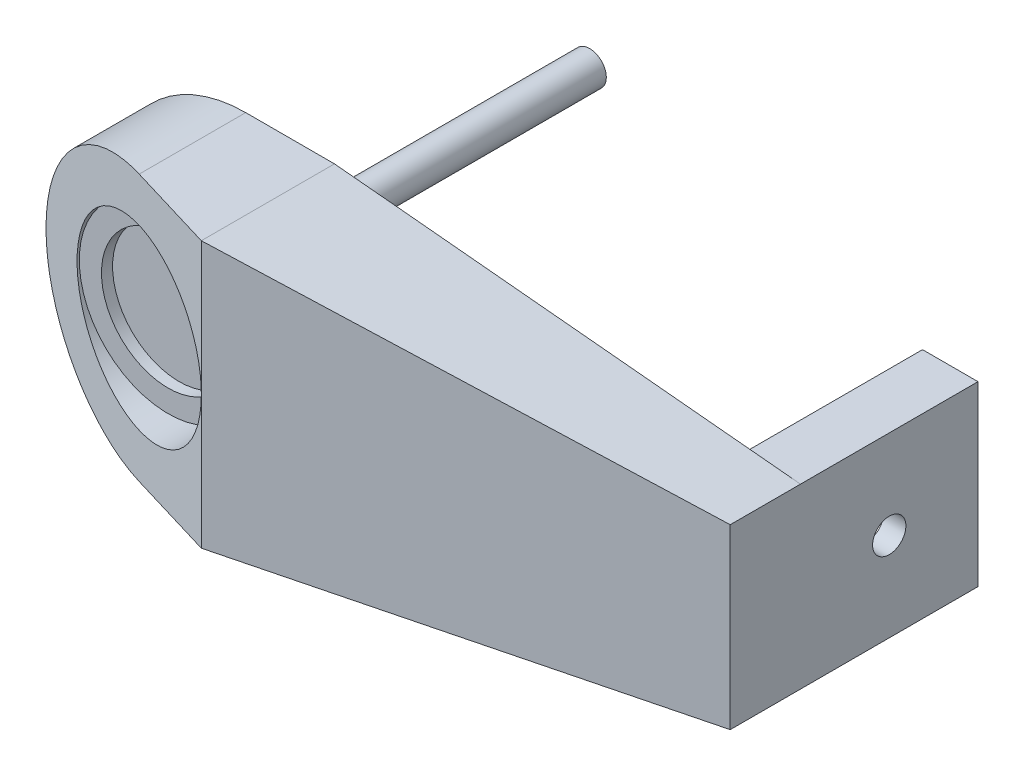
ISO-10303-21;
HEADER;
FILE_DESCRIPTION(('STEP AP214'),'2;1');
FILE_NAME('part.step','',(''),(''),'','','');
FILE_SCHEMA(('AUTOMOTIVE_DESIGN { 1 0 10303 214 1 1 1 1 }'));
ENDSEC;
DATA;
#1=APPLICATION_CONTEXT('core data for automotive mechanical design processes');
#2=APPLICATION_PROTOCOL_DEFINITION('international standard','automotive_design',2000,#1);
#3=PRODUCT_CONTEXT('',#1,'mechanical');
#4=PRODUCT('Part','Part','',(#3));
#5=PRODUCT_RELATED_PRODUCT_CATEGORY('part','',(#4));
#6=PRODUCT_DEFINITION_FORMATION('','',#4);
#7=PRODUCT_DEFINITION_CONTEXT('part definition',#1,'design');
#8=PRODUCT_DEFINITION('design','',#6,#7);
#9=PRODUCT_DEFINITION_SHAPE('','',#8);
#10=(LENGTH_UNIT() NAMED_UNIT(*) SI_UNIT(.MILLI.,.METRE.));
#11=(NAMED_UNIT(*) PLANE_ANGLE_UNIT() SI_UNIT($,.RADIAN.));
#12=(NAMED_UNIT(*) SI_UNIT($,.STERADIAN.) SOLID_ANGLE_UNIT());
#13=UNCERTAINTY_MEASURE_WITH_UNIT(LENGTH_MEASURE(1.E-05),#10,'distance_accuracy_value','');
#14=(GEOMETRIC_REPRESENTATION_CONTEXT(3) GLOBAL_UNCERTAINTY_ASSIGNED_CONTEXT((#13)) GLOBAL_UNIT_ASSIGNED_CONTEXT((#10,
#11,#12)) REPRESENTATION_CONTEXT('',''));
#15=CARTESIAN_POINT('',(0.,0.,0.));
#16=DIRECTION('',(0.,0.,1.));
#17=DIRECTION('',(1.,0.,0.));
#18=AXIS2_PLACEMENT_3D('',#15,#16,#17);
#19=CARTESIAN_POINT('',(0.,0.,-60.));
#20=DIRECTION('',(0.,0.,-1.));
#21=DIRECTION('',(-1.,0.,0.));
#22=AXIS2_PLACEMENT_3D('',#19,#20,#21);
#23=PLANE('',#22);
#24=CARTESIAN_POINT('',(-880.,0.,-60.));
#25=DIRECTION('',(0.,0.,-1.));
#26=DIRECTION('',(-1.,0.,0.));
#27=AXIS2_PLACEMENT_3D('',#24,#25,#26);
#28=CIRCLE('',#27,15.);
#29=CARTESIAN_POINT('',(-895.,0.,-60.));
#30=VERTEX_POINT('',#29);
#31=EDGE_CURVE('E45',#30,#30,#28,.T.);
#32=ORIENTED_EDGE('',*,*,#31,.F.);
#33=EDGE_LOOP('',(#32));
#34=FACE_BOUND('',#33,.T.);
#35=DIRECTION('',(-1.,0.,0.));
#36=VECTOR('',#35,1.);
#37=CARTESIAN_POINT('',(-1000.,120.,-60.));
#38=LINE('',#37,#36);
#39=CARTESIAN_POINT('',(-800.,120.,-60.));
#40=VERTEX_POINT('',#39);
#41=CARTESIAN_POINT('',(-880.,120.,-60.));
#42=VERTEX_POINT('',#41);
#43=EDGE_CURVE('E150',#40,#42,#38,.T.);
#44=ORIENTED_EDGE('',*,*,#43,.F.);
#45=DIRECTION('',(0.995495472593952,-0.0948090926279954,0.));
#46=VECTOR('',#45,1.);
#47=CARTESIAN_POINT('',(4.13483146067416,43.4157303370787,-60.));
#48=LINE('',#47,#46);
#49=CARTESIAN_POINT('',(-380.,80.,-60.));
#50=VERTEX_POINT('',#49);
#51=EDGE_CURVE('E171',#40,#50,#48,.T.);
#52=ORIENTED_EDGE('',*,*,#51,.T.);
#53=DIRECTION('',(1.,0.,0.));
#54=VECTOR('',#53,1.);
#55=CARTESIAN_POINT('',(-380.,80.,-60.));
#56=LINE('',#55,#54);
#57=CARTESIAN_POINT('',(-430.,80.,-60.));
#58=VERTEX_POINT('',#57);
#59=EDGE_CURVE('E211',#58,#50,#56,.T.);
#60=ORIENTED_EDGE('',*,*,#59,.F.);
#61=DIRECTION('',(0.,-1.,0.));
#62=VECTOR('',#61,1.);
#63=CARTESIAN_POINT('',(-430.,80.,-60.));
#64=LINE('',#63,#62);
#65=CARTESIAN_POINT('',(-430.,-80.,-60.));
#66=VERTEX_POINT('',#65);
#67=EDGE_CURVE('E214',#58,#66,#64,.T.);
#68=ORIENTED_EDGE('',*,*,#67,.T.);
#69=DIRECTION('',(1.,0.,0.));
#70=VECTOR('',#69,1.);
#71=CARTESIAN_POINT('',(-380.,-80.,-60.));
#72=LINE('',#71,#70);
#73=CARTESIAN_POINT('',(-380.,-80.,-60.));
#74=VERTEX_POINT('',#73);
#75=EDGE_CURVE('E201',#66,#74,#72,.T.);
#76=ORIENTED_EDGE('',*,*,#75,.T.);
#77=DIRECTION('',(-0.995495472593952,-0.0948090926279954,0.));
#78=VECTOR('',#77,1.);
#79=CARTESIAN_POINT('',(4.13483146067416,-43.4157303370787,-60.));
#80=LINE('',#79,#78);
#81=CARTESIAN_POINT('',(-800.,-120.,-60.0000000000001));
#82=VERTEX_POINT('',#81);
#83=EDGE_CURVE('E178',#74,#82,#80,.T.);
#84=ORIENTED_EDGE('',*,*,#83,.T.);
#85=DIRECTION('',(1.,0.,0.));
#86=VECTOR('',#85,1.);
#87=CARTESIAN_POINT('',(-1000.,-120.,-60.));
#88=LINE('',#87,#86);
#89=CARTESIAN_POINT('',(-880.,-120.,-60.0000000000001));
#90=VERTEX_POINT('',#89);
#91=EDGE_CURVE('E135',#90,#82,#88,.T.);
#92=ORIENTED_EDGE('',*,*,#91,.F.);
#93=CARTESIAN_POINT('',(-880.,0.,-60.));
#94=DIRECTION('',(0.,0.,-1.));
#95=DIRECTION('',(-1.,0.,0.));
#96=AXIS2_PLACEMENT_3D('',#93,#94,#95);
#97=CIRCLE('',#96,120.);
#98=EDGE_CURVE('E152',#42,#90,#97,.F.);
#99=ORIENTED_EDGE('',*,*,#98,.F.);
#100=EDGE_LOOP('',(#44,#52,#60,#68,#76,#84,#92,#99));
#101=FACE_BOUND('',#100,.T.);
#102=ADVANCED_FACE('F37',(#34,#101),#23,.T.);
#103=CARTESIAN_POINT('',(-1000.,-120.,60.));
#104=DIRECTION('',(0.,1.,0.));
#105=DIRECTION('',(0.,0.,1.));
#106=AXIS2_PLACEMENT_3D('',#103,#104,#105);
#107=PLANE('',#106);
#108=DIRECTION('',(0.,0.,-1.));
#109=VECTOR('',#108,1.);
#110=CARTESIAN_POINT('',(-800.,-120.,273.));
#111=LINE('',#110,#109);
#112=CARTESIAN_POINT('',(-800.,-120.,60.));
#113=VERTEX_POINT('',#112);
#114=EDGE_CURVE('E125',#113,#82,#111,.T.);
#115=ORIENTED_EDGE('',*,*,#114,.F.);
#116=DIRECTION('',(-0.957826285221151,0.,-0.287347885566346));
#117=VECTOR('',#116,1.);
#118=CARTESIAN_POINT('',(-983.48623853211,-120.,4.95412844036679));
#119=LINE('',#118,#117);
#120=CARTESIAN_POINT('',(-880.,-120.,35.9999999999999));
#121=VERTEX_POINT('',#120);
#122=EDGE_CURVE('E133',#113,#121,#119,.T.);
#123=ORIENTED_EDGE('',*,*,#122,.T.);
#124=DIRECTION('',(0.,0.,1.));
#125=VECTOR('',#124,1.);
#126=CARTESIAN_POINT('',(-880.,-120.,-203.));
#127=LINE('',#126,#125);
#128=EDGE_CURVE('E142',#90,#121,#127,.T.);
#129=ORIENTED_EDGE('',*,*,#128,.F.);
#130=ORIENTED_EDGE('',*,*,#91,.T.);
#131=EDGE_LOOP('',(#115,#123,#129,#130));
#132=FACE_BOUND('',#131,.T.);
#133=ADVANCED_FACE('F39',(#132),#107,.F.);
#134=CARTESIAN_POINT('',(-1000.,120.,60.));
#135=DIRECTION('',(0.,-1.,0.));
#136=DIRECTION('',(0.,0.,-1.));
#137=AXIS2_PLACEMENT_3D('',#134,#135,#136);
#138=PLANE('',#137);
#139=DIRECTION('',(0.,0.,-1.));
#140=VECTOR('',#139,1.);
#141=CARTESIAN_POINT('',(-800.,120.,273.));
#142=LINE('',#141,#140);
#143=CARTESIAN_POINT('',(-800.,120.,60.));
#144=VERTEX_POINT('',#143);
#145=EDGE_CURVE('E184',#144,#40,#142,.T.);
#146=ORIENTED_EDGE('',*,*,#145,.T.);
#147=ORIENTED_EDGE('',*,*,#43,.T.);
#148=DIRECTION('',(0.,0.,1.));
#149=VECTOR('',#148,1.);
#150=CARTESIAN_POINT('',(-880.,120.,-203.));
#151=LINE('',#150,#149);
#152=CARTESIAN_POINT('',(-880.,120.,35.9999999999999));
#153=VERTEX_POINT('',#152);
#154=EDGE_CURVE('E138',#42,#153,#151,.T.);
#155=ORIENTED_EDGE('',*,*,#154,.T.);
#156=DIRECTION('',(0.957826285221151,0.,0.287347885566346));
#157=VECTOR('',#156,1.);
#158=CARTESIAN_POINT('',(-983.48623853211,120.,4.95412844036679));
#159=LINE('',#158,#157);
#160=EDGE_CURVE('E139',#153,#144,#159,.T.);
#161=ORIENTED_EDGE('',*,*,#160,.T.);
#162=EDGE_LOOP('',(#146,#147,#155,#161));
#163=FACE_BOUND('',#162,.T.);
#164=ADVANCED_FACE('F223',(#163),#138,.F.);
#165=CARTESIAN_POINT('',(-380.,-344.,189.460686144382));
#166=DIRECTION('',(-1.,0.,0.));
#167=DIRECTION('',(0.,0.,1.));
#168=AXIS2_PLACEMENT_3D('',#165,#166,#167);
#169=PLANE('',#168);
#170=CARTESIAN_POINT('',(-380.,0.,-140.));
#171=DIRECTION('',(-1.,0.,0.));
#172=DIRECTION('',(0.,0.,1.));
#173=AXIS2_PLACEMENT_3D('',#170,#171,#172);
#174=CIRCLE('',#173,15.);
#175=CARTESIAN_POINT('',(-380.,0.,-125.));
#176=VERTEX_POINT('',#175);
#177=EDGE_CURVE('E170',#176,#176,#174,.T.);
#178=ORIENTED_EDGE('',*,*,#177,.T.);
#179=EDGE_LOOP('',(#178));
#180=FACE_BOUND('',#179,.T.);
#181=DIRECTION('',(0.,0.,-1.));
#182=VECTOR('',#181,1.);
#183=CARTESIAN_POINT('',(-380.,80.,273.));
#184=LINE('',#183,#182);
#185=CARTESIAN_POINT('',(-380.,80.,3.30767570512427));
#186=VERTEX_POINT('',#185);
#187=EDGE_CURVE('E237',#186,#50,#184,.T.);
#188=ORIENTED_EDGE('',*,*,#187,.F.);
#189=DIRECTION('',(0.,-1.,0.));
#190=VECTOR('',#189,1.);
#191=CARTESIAN_POINT('',(-380.,-344.,3.30767570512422));
#192=LINE('',#191,#190);
#193=CARTESIAN_POINT('',(-380.,-80.0000000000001,3.30767570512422));
#194=VERTEX_POINT('',#193);
#195=EDGE_CURVE('E51',#186,#194,#192,.T.);
#196=ORIENTED_EDGE('',*,*,#195,.T.);
#197=DIRECTION('',(0.,0.,-1.));
#198=VECTOR('',#197,1.);
#199=CARTESIAN_POINT('',(-380.,-80.,273.));
#200=LINE('',#199,#198);
#201=EDGE_CURVE('E127',#194,#74,#200,.T.);
#202=ORIENTED_EDGE('',*,*,#201,.T.);
#203=DIRECTION('',(0.,0.,-1.));
#204=VECTOR('',#203,1.);
#205=CARTESIAN_POINT('',(-380.,-80.,-60.));
#206=LINE('',#205,#204);
#207=CARTESIAN_POINT('',(-380.,-80.,-220.));
#208=VERTEX_POINT('',#207);
#209=EDGE_CURVE('E193',#74,#208,#206,.T.);
#210=ORIENTED_EDGE('',*,*,#209,.T.);
#211=DIRECTION('',(0.,-1.,0.));
#212=VECTOR('',#211,1.);
#213=CARTESIAN_POINT('',(-380.,80.,-220.));
#214=LINE('',#213,#212);
#215=CARTESIAN_POINT('',(-380.,80.,-220.));
#216=VERTEX_POINT('',#215);
#217=EDGE_CURVE('E167',#216,#208,#214,.T.);
#218=ORIENTED_EDGE('',*,*,#217,.F.);
#219=DIRECTION('',(0.,0.,-1.));
#220=VECTOR('',#219,1.);
#221=CARTESIAN_POINT('',(-380.,80.,-60.));
#222=LINE('',#221,#220);
#223=EDGE_CURVE('E204',#50,#216,#222,.T.);
#224=ORIENTED_EDGE('',*,*,#223,.F.);
#225=EDGE_LOOP('',(#188,#196,#202,#210,#218,#224));
#226=FACE_BOUND('',#225,.T.);
#227=ADVANCED_FACE('F236',(#180,#226),#169,.F.);
#228=CARTESIAN_POINT('',(-880.,0.,-203.));
#229=DIRECTION('',(0.,0.,1.));
#230=DIRECTION('',(1.,0.,0.));
#231=AXIS2_PLACEMENT_3D('',#228,#229,#230);
#232=CYLINDRICAL_SURFACE('',#231,120.);
#233=ORIENTED_EDGE('',*,*,#128,.T.);
#234=CARTESIAN_POINT('',(-880.,0.,35.9999999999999));
#235=DIRECTION('',(0.287347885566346,0.,-0.957826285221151));
#236=DIRECTION('',(0.957826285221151,0.,0.287347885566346));
#237=AXIS2_PLACEMENT_3D('',#234,#235,#236);
#238=ELLIPSE('',#237,125.283678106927,120.);
#239=EDGE_CURVE('E59',#121,#153,#238,.T.);
#240=ORIENTED_EDGE('',*,*,#239,.T.);
#241=ORIENTED_EDGE('',*,*,#154,.F.);
#242=ORIENTED_EDGE('',*,*,#98,.T.);
#243=EDGE_LOOP('',(#233,#240,#241,#242));
#244=FACE_BOUND('',#243,.T.);
#245=ADVANCED_FACE('F226',(#244),#232,.T.);
#246=CARTESIAN_POINT('',(-800.,-321.,60.));
#247=DIRECTION('',(0.287347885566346,0.,-0.957826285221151));
#248=DIRECTION('',(-0.957826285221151,0.,-0.287347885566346));
#249=AXIS2_PLACEMENT_3D('',#246,#247,#248);
#250=PLANE('',#249);
#251=DIRECTION('',(0.,1.,0.));
#252=VECTOR('',#251,1.);
#253=CARTESIAN_POINT('',(-800.,-321.,60.));
#254=LINE('',#253,#252);
#255=CARTESIAN_POINT('',(-800.,0.,60.));
#256=VERTEX_POINT('',#255);
#257=EDGE_CURVE('E109',#113,#256,#254,.T.);
#258=ORIENTED_EDGE('',*,*,#257,.T.);
#259=CARTESIAN_POINT('',(-880.,0.,35.9999999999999));
#260=DIRECTION('',(0.287347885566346,0.,-0.957826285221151));
#261=DIRECTION('',(-0.957826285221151,0.,-0.287347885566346));
#262=AXIS2_PLACEMENT_3D('',#259,#260,#261);
#263=ELLIPSE('',#262,83.5224520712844,80.);
#264=EDGE_CURVE('E154',#256,#256,#263,.T.);
#265=ORIENTED_EDGE('',*,*,#264,.T.);
#266=EDGE_CURVE('E114',#256,#144,#254,.T.);
#267=ORIENTED_EDGE('',*,*,#266,.T.);
#268=ORIENTED_EDGE('',*,*,#160,.F.);
#269=ORIENTED_EDGE('',*,*,#239,.F.);
#270=ORIENTED_EDGE('',*,*,#122,.F.);
#271=EDGE_LOOP('',(#258,#265,#267,#268,#269,#270));
#272=FACE_BOUND('',#271,.T.);
#273=ADVANCED_FACE('F137',(#272),#250,.F.);
#274=CARTESIAN_POINT('',(-880.,0.,332.));
#275=DIRECTION('',(0.,0.,-1.));
#276=DIRECTION('',(-1.,0.,0.));
#277=AXIS2_PLACEMENT_3D('',#274,#275,#276);
#278=CYLINDRICAL_SURFACE('',#277,80.);
#279=CARTESIAN_POINT('',(-880.,0.,10.));
#280=DIRECTION('',(0.,0.,1.));
#281=DIRECTION('',(1.,0.,0.));
#282=AXIS2_PLACEMENT_3D('',#279,#280,#281);
#283=CIRCLE('',#282,80.);
#284=CARTESIAN_POINT('',(-800.,0.,10.));
#285=VERTEX_POINT('',#284);
#286=EDGE_CURVE('E156',#285,#285,#283,.T.);
#287=ORIENTED_EDGE('',*,*,#286,.F.);
#288=EDGE_LOOP('',(#287));
#289=FACE_BOUND('',#288,.T.);
#290=ORIENTED_EDGE('',*,*,#264,.F.);
#291=EDGE_LOOP('',(#290));
#292=FACE_BOUND('',#291,.T.);
#293=ADVANCED_FACE('F297',(#289,#292),#278,.F.);
#294=CARTESIAN_POINT('',(-880.,0.,10.));
#295=DIRECTION('',(0.,0.,1.));
#296=DIRECTION('',(1.,0.,0.));
#297=AXIS2_PLACEMENT_3D('',#294,#295,#296);
#298=PLANE('',#297);
#299=ORIENTED_EDGE('',*,*,#286,.T.);
#300=EDGE_LOOP('',(#299));
#301=FACE_BOUND('',#300,.T.);
#302=CARTESIAN_POINT('',(-880.,0.,10.));
#303=DIRECTION('',(0.,0.,1.));
#304=DIRECTION('',(1.,0.,0.));
#305=AXIS2_PLACEMENT_3D('',#302,#303,#304);
#306=CIRCLE('',#305,60.);
#307=CARTESIAN_POINT('',(-820.,0.,10.));
#308=VERTEX_POINT('',#307);
#309=EDGE_CURVE('E166',#308,#308,#306,.T.);
#310=ORIENTED_EDGE('',*,*,#309,.F.);
#311=EDGE_LOOP('',(#310));
#312=FACE_BOUND('',#311,.T.);
#313=ADVANCED_FACE('F293',(#301,#312),#298,.T.);
#314=CARTESIAN_POINT('',(-880.,0.,10.));
#315=DIRECTION('',(0.,0.,-1.));
#316=DIRECTION('',(-1.,0.,0.));
#317=AXIS2_PLACEMENT_3D('',#314,#315,#316);
#318=CYLINDRICAL_SURFACE('',#317,60.);
#319=ORIENTED_EDGE('',*,*,#309,.T.);
#320=EDGE_LOOP('',(#319));
#321=FACE_BOUND('',#320,.T.);
#322=CARTESIAN_POINT('',(-880.,0.,0.));
#323=DIRECTION('',(0.,0.,1.));
#324=DIRECTION('',(1.,0.,0.));
#325=AXIS2_PLACEMENT_3D('',#322,#323,#324);
#326=CIRCLE('',#325,60.);
#327=CARTESIAN_POINT('',(-820.,0.,0.));
#328=VERTEX_POINT('',#327);
#329=EDGE_CURVE('E159',#328,#328,#326,.F.);
#330=ORIENTED_EDGE('',*,*,#329,.T.);
#331=EDGE_LOOP('',(#330));
#332=FACE_BOUND('',#331,.T.);
#333=ADVANCED_FACE('F290',(#321,#332),#318,.F.);
#334=CARTESIAN_POINT('',(-880.,0.,0.));
#335=DIRECTION('',(0.,0.,1.));
#336=DIRECTION('',(1.,0.,0.));
#337=AXIS2_PLACEMENT_3D('',#334,#335,#336);
#338=PLANE('',#337);
#339=ORIENTED_EDGE('',*,*,#329,.F.);
#340=EDGE_LOOP('',(#339));
#341=FACE_BOUND('',#340,.T.);
#342=ADVANCED_FACE('F288',(#341),#338,.T.);
#343=CARTESIAN_POINT('',(-880.,0.,-530.));
#344=DIRECTION('',(0.,0.,1.));
#345=DIRECTION('',(1.,0.,0.));
#346=AXIS2_PLACEMENT_3D('',#343,#344,#345);
#347=CYLINDRICAL_SURFACE('',#346,15.);
#348=CARTESIAN_POINT('',(-880.,0.,-370.));
#349=DIRECTION('',(0.,0.,1.));
#350=DIRECTION('',(1.,0.,0.));
#351=AXIS2_PLACEMENT_3D('',#348,#349,#350);
#352=CIRCLE('',#351,15.);
#353=CARTESIAN_POINT('',(-865.,0.,-370.));
#354=VERTEX_POINT('',#353);
#355=EDGE_CURVE('E164',#354,#354,#352,.F.);
#356=ORIENTED_EDGE('',*,*,#355,.F.);
#357=EDGE_LOOP('',(#356));
#358=FACE_BOUND('',#357,.T.);
#359=ORIENTED_EDGE('',*,*,#31,.T.);
#360=EDGE_LOOP('',(#359));
#361=FACE_BOUND('',#360,.T.);
#362=ADVANCED_FACE('F261',(#358,#361),#347,.T.);
#363=CARTESIAN_POINT('',(-1021.46300354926,-193.,-370.));
#364=DIRECTION('',(0.,0.,1.));
#365=DIRECTION('',(1.,0.,0.));
#366=AXIS2_PLACEMENT_3D('',#363,#364,#365);
#367=PLANE('',#366);
#368=ORIENTED_EDGE('',*,*,#355,.T.);
#369=EDGE_LOOP('',(#368));
#370=FACE_BOUND('',#369,.T.);
#371=ADVANCED_FACE('F253',(#370),#367,.F.);
#372=CARTESIAN_POINT('',(-380.,80.,-220.));
#373=DIRECTION('',(0.,0.,1.));
#374=DIRECTION('',(1.,0.,0.));
#375=AXIS2_PLACEMENT_3D('',#372,#373,#374);
#376=PLANE('',#375);
#377=ORIENTED_EDGE('',*,*,#217,.T.);
#378=DIRECTION('',(-1.,0.,0.));
#379=VECTOR('',#378,1.);
#380=CARTESIAN_POINT('',(-380.,-80.,-220.));
#381=LINE('',#380,#379);
#382=CARTESIAN_POINT('',(-430.,-80.,-220.));
#383=VERTEX_POINT('',#382);
#384=EDGE_CURVE('E196',#208,#383,#381,.T.);
#385=ORIENTED_EDGE('',*,*,#384,.T.);
#386=DIRECTION('',(0.,-1.,0.));
#387=VECTOR('',#386,1.);
#388=CARTESIAN_POINT('',(-430.,80.,-220.));
#389=LINE('',#388,#387);
#390=CARTESIAN_POINT('',(-430.,80.,-220.));
#391=VERTEX_POINT('',#390);
#392=EDGE_CURVE('E217',#391,#383,#389,.T.);
#393=ORIENTED_EDGE('',*,*,#392,.F.);
#394=DIRECTION('',(-1.,0.,0.));
#395=VECTOR('',#394,1.);
#396=CARTESIAN_POINT('',(-380.,80.,-220.));
#397=LINE('',#396,#395);
#398=EDGE_CURVE('E207',#216,#391,#397,.T.);
#399=ORIENTED_EDGE('',*,*,#398,.F.);
#400=EDGE_LOOP('',(#377,#385,#393,#399));
#401=FACE_BOUND('',#400,.T.);
#402=ADVANCED_FACE('F251',(#401),#376,.F.);
#403=CARTESIAN_POINT('',(-430.,80.,-60.));
#404=DIRECTION('',(1.,0.,0.));
#405=DIRECTION('',(0.,0.,-1.));
#406=AXIS2_PLACEMENT_3D('',#403,#404,#405);
#407=PLANE('',#406);
#408=CARTESIAN_POINT('',(-430.,0.,-140.));
#409=DIRECTION('',(-1.,0.,0.));
#410=DIRECTION('',(0.,0.,1.));
#411=AXIS2_PLACEMENT_3D('',#408,#409,#410);
#412=CIRCLE('',#411,70.);
#413=CARTESIAN_POINT('',(-430.,0.,-70.));
#414=VERTEX_POINT('',#413);
#415=EDGE_CURVE('E190',#414,#414,#412,.T.);
#416=ORIENTED_EDGE('',*,*,#415,.F.);
#417=EDGE_LOOP('',(#416));
#418=FACE_BOUND('',#417,.T.);
#419=ORIENTED_EDGE('',*,*,#392,.T.);
#420=DIRECTION('',(0.,0.,1.));
#421=VECTOR('',#420,1.);
#422=CARTESIAN_POINT('',(-430.,-80.,-60.));
#423=LINE('',#422,#421);
#424=EDGE_CURVE('E199',#383,#66,#423,.T.);
#425=ORIENTED_EDGE('',*,*,#424,.T.);
#426=ORIENTED_EDGE('',*,*,#67,.F.);
#427=DIRECTION('',(0.,0.,1.));
#428=VECTOR('',#427,1.);
#429=CARTESIAN_POINT('',(-430.,80.,-60.));
#430=LINE('',#429,#428);
#431=EDGE_CURVE('E209',#391,#58,#430,.T.);
#432=ORIENTED_EDGE('',*,*,#431,.F.);
#433=EDGE_LOOP('',(#419,#425,#426,#432));
#434=FACE_BOUND('',#433,.T.);
#435=ADVANCED_FACE('F248',(#418,#434),#407,.F.);
#436=CARTESIAN_POINT('',(0.,80.,0.));
#437=DIRECTION('',(0.,1.,0.));
#438=DIRECTION('',(0.,0.,1.));
#439=AXIS2_PLACEMENT_3D('',#436,#437,#438);
#440=PLANE('',#439);
#441=ORIENTED_EDGE('',*,*,#223,.T.);
#442=ORIENTED_EDGE('',*,*,#398,.T.);
#443=ORIENTED_EDGE('',*,*,#431,.T.);
#444=ORIENTED_EDGE('',*,*,#59,.T.);
#445=EDGE_LOOP('',(#441,#442,#443,#444));
#446=FACE_BOUND('',#445,.T.);
#447=ADVANCED_FACE('F244',(#446),#440,.T.);
#448=CARTESIAN_POINT('',(0.,-80.,0.));
#449=DIRECTION('',(0.,1.,0.));
#450=DIRECTION('',(0.,0.,1.));
#451=AXIS2_PLACEMENT_3D('',#448,#449,#450);
#452=PLANE('',#451);
#453=ORIENTED_EDGE('',*,*,#209,.F.);
#454=ORIENTED_EDGE('',*,*,#75,.F.);
#455=ORIENTED_EDGE('',*,*,#424,.F.);
#456=ORIENTED_EDGE('',*,*,#384,.F.);
#457=EDGE_LOOP('',(#453,#454,#455,#456));
#458=FACE_BOUND('',#457,.T.);
#459=ADVANCED_FACE('F231',(#458),#452,.F.);
#460=CARTESIAN_POINT('',(-462.36625471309,0.,-140.));
#461=DIRECTION('',(-1.,0.,0.));
#462=DIRECTION('',(0.,0.,1.));
#463=AXIS2_PLACEMENT_3D('',#460,#461,#462);
#464=CYLINDRICAL_SURFACE('',#463,70.);
#465=ORIENTED_EDGE('',*,*,#415,.T.);
#466=EDGE_LOOP('',(#465));
#467=FACE_BOUND('',#466,.T.);
#468=CARTESIAN_POINT('',(-400.,0.,-140.));
#469=DIRECTION('',(-1.,0.,0.));
#470=DIRECTION('',(0.,0.,1.));
#471=AXIS2_PLACEMENT_3D('',#468,#469,#470);
#472=CIRCLE('',#471,70.);
#473=CARTESIAN_POINT('',(-400.,0.,-70.));
#474=VERTEX_POINT('',#473);
#475=EDGE_CURVE('E175',#474,#474,#472,.T.);
#476=ORIENTED_EDGE('',*,*,#475,.F.);
#477=EDGE_LOOP('',(#476));
#478=FACE_BOUND('',#477,.T.);
#479=ADVANCED_FACE('F349',(#467,#478),#464,.F.);
#480=CARTESIAN_POINT('',(-400.,0.,-140.));
#481=DIRECTION('',(-1.,0.,0.));
#482=DIRECTION('',(0.,0.,1.));
#483=AXIS2_PLACEMENT_3D('',#480,#481,#482);
#484=PLANE('',#483);
#485=CARTESIAN_POINT('',(-400.,0.,-140.));
#486=DIRECTION('',(-1.,0.,0.));
#487=DIRECTION('',(0.,0.,1.));
#488=AXIS2_PLACEMENT_3D('',#485,#486,#487);
#489=CIRCLE('',#488,15.);
#490=CARTESIAN_POINT('',(-400.,0.,-125.));
#491=VERTEX_POINT('',#490);
#492=EDGE_CURVE('E168',#491,#491,#489,.T.);
#493=ORIENTED_EDGE('',*,*,#492,.F.);
#494=EDGE_LOOP('',(#493));
#495=FACE_BOUND('',#494,.T.);
#496=ORIENTED_EDGE('',*,*,#475,.T.);
#497=EDGE_LOOP('',(#496));
#498=FACE_BOUND('',#497,.T.);
#499=ADVANCED_FACE('F346',(#495,#498),#484,.T.);
#500=CARTESIAN_POINT('',(-523.,0.,-140.));
#501=DIRECTION('',(1.,0.,0.));
#502=DIRECTION('',(0.,0.,-1.));
#503=AXIS2_PLACEMENT_3D('',#500,#501,#502);
#504=CYLINDRICAL_SURFACE('',#503,15.);
#505=ORIENTED_EDGE('',*,*,#492,.T.);
#506=EDGE_LOOP('',(#505));
#507=FACE_BOUND('',#506,.T.);
#508=ORIENTED_EDGE('',*,*,#177,.F.);
#509=EDGE_LOOP('',(#508));
#510=FACE_BOUND('',#509,.T.);
#511=ADVANCED_FACE('F322',(#507,#510),#504,.F.);
#512=CARTESIAN_POINT('',(-380.,-80.,273.));
#513=DIRECTION('',(0.0948090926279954,-0.995495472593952,0.));
#514=DIRECTION('',(0.995495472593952,0.0948090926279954,0.));
#515=AXIS2_PLACEMENT_3D('',#512,#513,#514);
#516=PLANE('',#515);
#517=DIRECTION('',(0.986627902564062,0.0939645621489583,-0.133176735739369));
#518=VECTOR('',#517,1.);
#519=CARTESIAN_POINT('',(-415.436461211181,-83.3749010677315,8.09095034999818));
#520=LINE('',#519,#518);
#521=EDGE_CURVE('E112',#113,#194,#520,.T.);
#522=ORIENTED_EDGE('',*,*,#521,.F.);
#523=ORIENTED_EDGE('',*,*,#114,.T.);
#524=ORIENTED_EDGE('',*,*,#83,.F.);
#525=ORIENTED_EDGE('',*,*,#201,.F.);
#526=EDGE_LOOP('',(#522,#523,#524,#525));
#527=FACE_BOUND('',#526,.T.);
#528=ADVANCED_FACE('F123',(#527),#516,.T.);
#529=CARTESIAN_POINT('',(-380.,80.,273.));
#530=DIRECTION('',(0.0948090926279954,0.995495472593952,0.));
#531=DIRECTION('',(-0.995495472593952,0.0948090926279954,0.));
#532=AXIS2_PLACEMENT_3D('',#529,#530,#531);
#533=PLANE('',#532);
#534=DIRECTION('',(-0.986627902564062,0.0939645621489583,0.133176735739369));
#535=VECTOR('',#534,1.);
#536=CARTESIAN_POINT('',(-415.436461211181,83.3749010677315,8.09095034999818));
#537=LINE('',#536,#535);
#538=EDGE_CURVE('E11',#186,#144,#537,.T.);
#539=ORIENTED_EDGE('',*,*,#538,.F.);
#540=ORIENTED_EDGE('',*,*,#187,.T.);
#541=ORIENTED_EDGE('',*,*,#51,.F.);
#542=ORIENTED_EDGE('',*,*,#145,.F.);
#543=EDGE_LOOP('',(#539,#540,#541,#542));
#544=FACE_BOUND('',#543,.T.);
#545=ADVANCED_FACE('F242',(#544),#533,.T.);
#546=CARTESIAN_POINT('',(-800.,-236.,60.));
#547=DIRECTION('',(-0.133768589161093,0.,-0.99101259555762));
#548=DIRECTION('',(-0.99101259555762,0.,0.133768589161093));
#549=AXIS2_PLACEMENT_3D('',#546,#547,#548);
#550=PLANE('',#549);
#551=ORIENTED_EDGE('',*,*,#521,.T.);
#552=ORIENTED_EDGE('',*,*,#195,.F.);
#553=ORIENTED_EDGE('',*,*,#538,.T.);
#554=ORIENTED_EDGE('',*,*,#266,.F.);
#555=ORIENTED_EDGE('',*,*,#257,.F.);
#556=EDGE_LOOP('',(#551,#552,#553,#554,#555));
#557=FACE_BOUND('',#556,.T.);
#558=ADVANCED_FACE('F111',(#557),#550,.F.);
#559=CLOSED_SHELL('',(#102,#133,#164,#227,#245,#273,#293,#313,#333,#342,#362,#371,#402,#435,
#447,#459,#479,#499,#511,#528,#545,#558));
#560=MANIFOLD_SOLID_BREP('B2',#559);
#561=ADVANCED_BREP_SHAPE_REPRESENTATION('',(#18,#560),#14);
#562=SHAPE_DEFINITION_REPRESENTATION(#9,#561);
ENDSEC;
END-ISO-10303-21;
